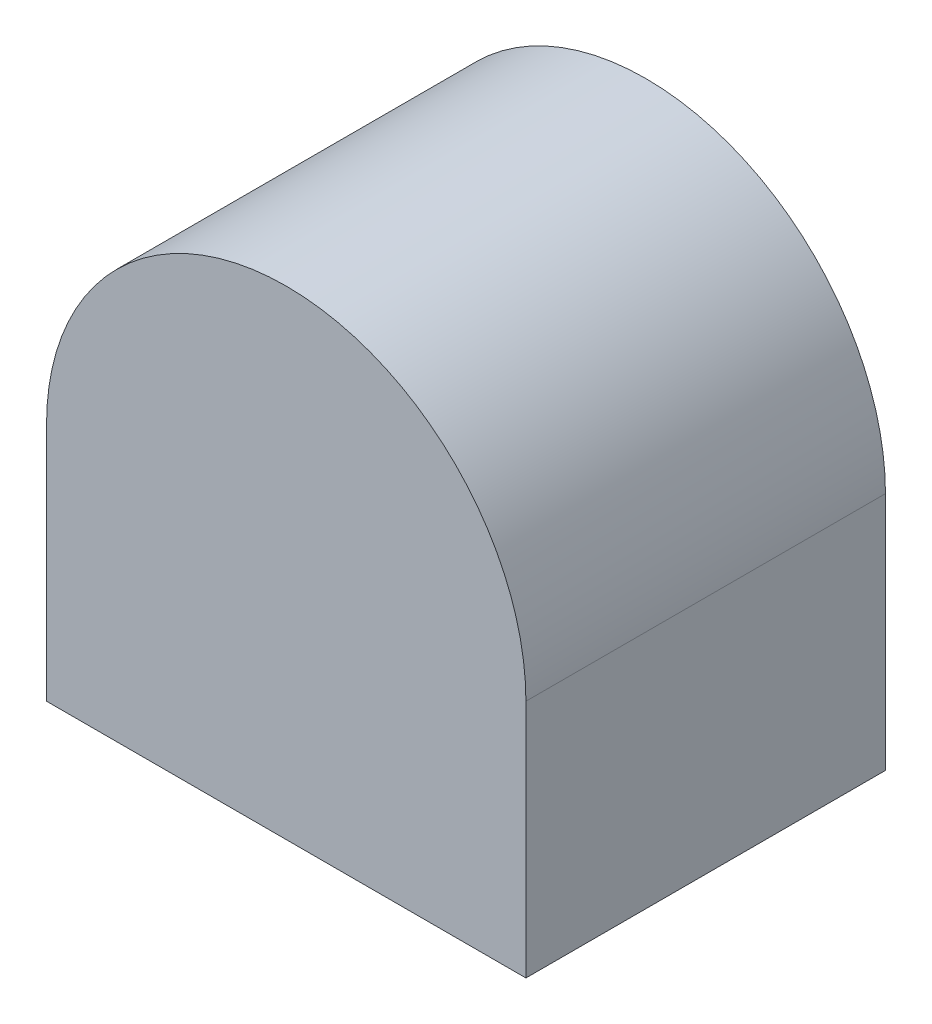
from build123d import *

# Parameters (mm, degrees)
EXTRUDE1_DEPTH = 37.5
FILLET1_RADIUS = 50
FILLET1_LENGTH = 75


with BuildPart() as part:
    # Sketch1 → Extrude1 (new, symmetric)
    with BuildSketch(Plane.XY):
        Polygon((-50, 100), (-50, 0), (50, 0), (50, 100), (0, 100), align=None)
    extrude(amount=EXTRUDE1_DEPTH, both=True)

    # Fillet1: full round fillet: the end face becomes a half cylinder, R = half its width
    fillet1_face = Plane((0, 100, 0), x_dir=(0, 0, -1), z_dir=(0, 1, 0))  # on the end face: x along it, z out of the body
    fillet1_slab = fillet1_face.offset(-FILLET1_RADIUS / 2) * Box(FILLET1_LENGTH, 2 * FILLET1_RADIUS, FILLET1_RADIUS, mode=Mode.PRIVATE)  # the body's end, R deep
    fillet1_round = Plane((0, 50, 0), x_dir=(0, 1, 0), z_dir=(0, 0, -1)) * Cylinder(FILLET1_RADIUS, FILLET1_LENGTH, mode=Mode.PRIVATE)  # its axis R under the face
    add(fillet1_slab - fillet1_round, mode=Mode.SUBTRACT)


solid = part.part
